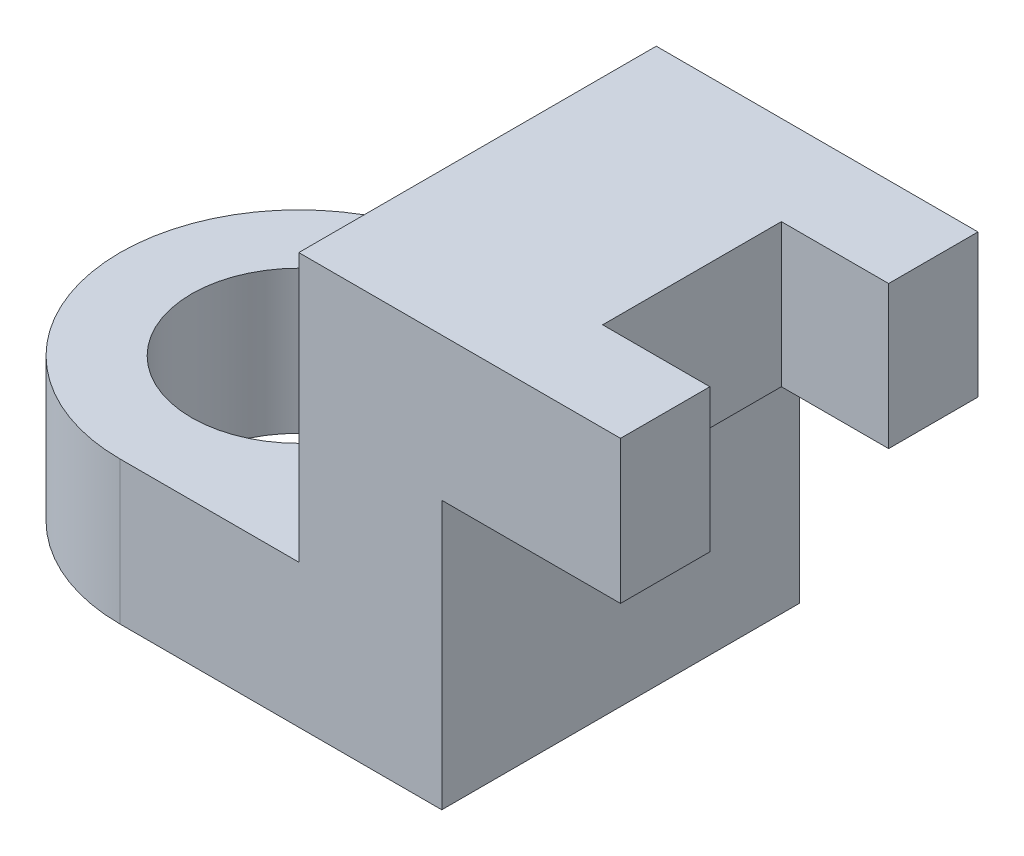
ISO-10303-21;
HEADER;
FILE_DESCRIPTION(('STEP AP214'),'2;1');
FILE_NAME('part.step','',(''),(''),'','','');
FILE_SCHEMA(('AUTOMOTIVE_DESIGN { 1 0 10303 214 1 1 1 1 }'));
ENDSEC;
DATA;
#1=APPLICATION_CONTEXT('core data for automotive mechanical design processes');
#2=APPLICATION_PROTOCOL_DEFINITION('international standard','automotive_design',2000,#1);
#3=PRODUCT_CONTEXT('',#1,'mechanical');
#4=PRODUCT('Part','Part','',(#3));
#5=PRODUCT_RELATED_PRODUCT_CATEGORY('part','',(#4));
#6=PRODUCT_DEFINITION_FORMATION('','',#4);
#7=PRODUCT_DEFINITION_CONTEXT('part definition',#1,'design');
#8=PRODUCT_DEFINITION('design','',#6,#7);
#9=PRODUCT_DEFINITION_SHAPE('','',#8);
#10=(LENGTH_UNIT() NAMED_UNIT(*) SI_UNIT(.MILLI.,.METRE.));
#11=(NAMED_UNIT(*) PLANE_ANGLE_UNIT() SI_UNIT($,.RADIAN.));
#12=(NAMED_UNIT(*) SI_UNIT($,.STERADIAN.) SOLID_ANGLE_UNIT());
#13=UNCERTAINTY_MEASURE_WITH_UNIT(LENGTH_MEASURE(1.E-05),#10,'distance_accuracy_value','');
#14=(GEOMETRIC_REPRESENTATION_CONTEXT(3) GLOBAL_UNCERTAINTY_ASSIGNED_CONTEXT((#13)) GLOBAL_UNIT_ASSIGNED_CONTEXT((#10,
#11,#12)) REPRESENTATION_CONTEXT('',''));
#15=CARTESIAN_POINT('',(0.,0.,0.));
#16=DIRECTION('',(0.,0.,1.));
#17=DIRECTION('',(1.,0.,0.));
#18=AXIS2_PLACEMENT_3D('',#15,#16,#17);
#19=CARTESIAN_POINT('',(38.,67.540659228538,-20.));
#20=DIRECTION('',(1.,0.,0.));
#21=DIRECTION('',(0.,0.,-1.));
#22=AXIS2_PLACEMENT_3D('',#19,#20,#21);
#23=PLANE('',#22);
#24=DIRECTION('',(0.,-1.,0.));
#25=VECTOR('',#24,1.);
#26=CARTESIAN_POINT('',(38.,67.540659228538,-5.));
#27=LINE('',#26,#25);
#28=CARTESIAN_POINT('',(38.,23.,-5.));
#29=VERTEX_POINT('',#28);
#30=CARTESIAN_POINT('',(38.,15.,-5.));
#31=VERTEX_POINT('',#30);
#32=EDGE_CURVE('E41',#29,#31,#27,.T.);
#33=ORIENTED_EDGE('',*,*,#32,.F.);
#34=DIRECTION('',(0.,0.,1.));
#35=VECTOR('',#34,1.);
#36=CARTESIAN_POINT('',(38.,23.,0.));
#37=LINE('',#36,#35);
#38=CARTESIAN_POINT('',(38.,23.,0.));
#39=VERTEX_POINT('',#38);
#40=EDGE_CURVE('E145',#29,#39,#37,.T.);
#41=ORIENTED_EDGE('',*,*,#40,.T.);
#42=DIRECTION('',(0.,-1.,0.));
#43=VECTOR('',#42,1.);
#44=CARTESIAN_POINT('',(38.,23.,0.));
#45=LINE('',#44,#43);
#46=CARTESIAN_POINT('',(38.,15.,0.));
#47=VERTEX_POINT('',#46);
#48=EDGE_CURVE('E144',#39,#47,#45,.T.);
#49=ORIENTED_EDGE('',*,*,#48,.T.);
#50=DIRECTION('',(0.,0.,-1.));
#51=VECTOR('',#50,1.);
#52=CARTESIAN_POINT('',(38.,15.,0.));
#53=LINE('',#52,#51);
#54=EDGE_CURVE('E221',#47,#31,#53,.T.);
#55=ORIENTED_EDGE('',*,*,#54,.T.);
#56=EDGE_LOOP('',(#33,#41,#49,#55));
#57=FACE_BOUND('',#56,.T.);
#58=ADVANCED_FACE('F33',(#57),#23,.T.);
#59=CARTESIAN_POINT('',(28.,8.,0.));
#60=DIRECTION('',(-1.,0.,0.));
#61=DIRECTION('',(0.,0.,1.));
#62=AXIS2_PLACEMENT_3D('',#59,#60,#61);
#63=PLANE('',#62);
#64=DIRECTION('',(0.,0.,-1.));
#65=VECTOR('',#64,1.);
#66=CARTESIAN_POINT('',(28.,15.,0.));
#67=LINE('',#66,#65);
#68=CARTESIAN_POINT('',(28.,15.,0.));
#69=VERTEX_POINT('',#68);
#70=CARTESIAN_POINT('',(28.,15.,-20.));
#71=VERTEX_POINT('',#70);
#72=EDGE_CURVE('E56',#69,#71,#67,.T.);
#73=ORIENTED_EDGE('',*,*,#72,.F.);
#74=DIRECTION('',(0.,-1.,0.));
#75=VECTOR('',#74,1.);
#76=CARTESIAN_POINT('',(28.,8.,0.));
#77=LINE('',#76,#75);
#78=CARTESIAN_POINT('',(28.,0.,0.));
#79=VERTEX_POINT('',#78);
#80=EDGE_CURVE('E242',#69,#79,#77,.T.);
#81=ORIENTED_EDGE('',*,*,#80,.T.);
#82=DIRECTION('',(0.,0.,-1.));
#83=VECTOR('',#82,1.);
#84=CARTESIAN_POINT('',(28.,0.,0.));
#85=LINE('',#84,#83);
#86=CARTESIAN_POINT('',(28.,0.,-20.));
#87=VERTEX_POINT('',#86);
#88=EDGE_CURVE('E248',#79,#87,#85,.T.);
#89=ORIENTED_EDGE('',*,*,#88,.T.);
#90=DIRECTION('',(0.,-1.,0.));
#91=VECTOR('',#90,1.);
#92=CARTESIAN_POINT('',(28.,8.,-20.));
#93=LINE('',#92,#91);
#94=EDGE_CURVE('E197',#71,#87,#93,.T.);
#95=ORIENTED_EDGE('',*,*,#94,.F.);
#96=EDGE_LOOP('',(#73,#81,#89,#95));
#97=FACE_BOUND('',#96,.T.);
#98=ADVANCED_FACE('F261',(#97),#63,.F.);
#99=CARTESIAN_POINT('',(10.,8.,-10.));
#100=DIRECTION('',(0.,-1.,0.));
#101=DIRECTION('',(0.,0.,-1.));
#102=AXIS2_PLACEMENT_3D('',#99,#100,#101);
#103=CYLINDRICAL_SURFACE('',#102,10.);
#104=DIRECTION('',(0.,-1.,0.));
#105=VECTOR('',#104,1.);
#106=CARTESIAN_POINT('',(10.,8.,0.));
#107=LINE('',#106,#105);
#108=CARTESIAN_POINT('',(10.,8.,0.));
#109=VERTEX_POINT('',#108);
#110=CARTESIAN_POINT('',(10.,0.,0.));
#111=VERTEX_POINT('',#110);
#112=EDGE_CURVE('E187',#109,#111,#107,.T.);
#113=ORIENTED_EDGE('',*,*,#112,.F.);
#114=CARTESIAN_POINT('',(10.,8.,-10.));
#115=DIRECTION('',(0.,-1.,0.));
#116=DIRECTION('',(0.,0.,-1.));
#117=AXIS2_PLACEMENT_3D('',#114,#115,#116);
#118=CIRCLE('',#117,10.);
#119=CARTESIAN_POINT('',(10.,8.,-20.));
#120=VERTEX_POINT('',#119);
#121=EDGE_CURVE('E417',#120,#109,#118,.F.);
#122=ORIENTED_EDGE('',*,*,#121,.F.);
#123=DIRECTION('',(0.,-1.,0.));
#124=VECTOR('',#123,1.);
#125=CARTESIAN_POINT('',(10.,8.,-20.));
#126=LINE('',#125,#124);
#127=CARTESIAN_POINT('',(10.,0.,-20.));
#128=VERTEX_POINT('',#127);
#129=EDGE_CURVE('E260',#128,#120,#126,.F.);
#130=ORIENTED_EDGE('',*,*,#129,.F.);
#131=CARTESIAN_POINT('',(10.,0.,-10.));
#132=DIRECTION('',(0.,-1.,0.));
#133=DIRECTION('',(0.,0.,-1.));
#134=AXIS2_PLACEMENT_3D('',#131,#132,#133);
#135=CIRCLE('',#134,10.);
#136=EDGE_CURVE('E129',#111,#128,#135,.T.);
#137=ORIENTED_EDGE('',*,*,#136,.F.);
#138=EDGE_LOOP('',(#113,#122,#130,#137));
#139=FACE_BOUND('',#138,.T.);
#140=ADVANCED_FACE('F35',(#139),#103,.T.);
#141=CARTESIAN_POINT('',(0.,8.,-20.));
#142=DIRECTION('',(0.,-1.,0.));
#143=DIRECTION('',(0.,0.,-1.));
#144=AXIS2_PLACEMENT_3D('',#141,#142,#143);
#145=PLANE('',#144);
#146=CARTESIAN_POINT('',(10.,8.,-10.));
#147=DIRECTION('',(0.,1.,0.));
#148=DIRECTION('',(0.,0.,1.));
#149=AXIS2_PLACEMENT_3D('',#146,#147,#148);
#150=CIRCLE('',#149,6.);
#151=CARTESIAN_POINT('',(10.,8.,-4.));
#152=VERTEX_POINT('',#151);
#153=EDGE_CURVE('E157',#152,#152,#150,.T.);
#154=ORIENTED_EDGE('',*,*,#153,.F.);
#155=EDGE_LOOP('',(#154));
#156=FACE_BOUND('',#155,.T.);
#157=DIRECTION('',(-1.,0.,0.));
#158=VECTOR('',#157,1.);
#159=CARTESIAN_POINT('',(0.,8.,-20.));
#160=LINE('',#159,#158);
#161=CARTESIAN_POINT('',(20.,8.,-20.));
#162=VERTEX_POINT('',#161);
#163=EDGE_CURVE('E185',#162,#120,#160,.T.);
#164=ORIENTED_EDGE('',*,*,#163,.T.);
#165=ORIENTED_EDGE('',*,*,#121,.T.);
#166=DIRECTION('',(1.,0.,0.));
#167=VECTOR('',#166,1.);
#168=CARTESIAN_POINT('',(0.,8.,0.));
#169=LINE('',#168,#167);
#170=CARTESIAN_POINT('',(20.,8.,0.));
#171=VERTEX_POINT('',#170);
#172=EDGE_CURVE('E183',#109,#171,#169,.T.);
#173=ORIENTED_EDGE('',*,*,#172,.T.);
#174=DIRECTION('',(0.,0.,1.));
#175=VECTOR('',#174,1.);
#176=CARTESIAN_POINT('',(20.,8.,-20.));
#177=LINE('',#176,#175);
#178=EDGE_CURVE('E156',#162,#171,#177,.T.);
#179=ORIENTED_EDGE('',*,*,#178,.F.);
#180=EDGE_LOOP('',(#164,#165,#173,#179));
#181=FACE_BOUND('',#180,.T.);
#182=ADVANCED_FACE('F268',(#156,#181),#145,.F.);
#183=CARTESIAN_POINT('',(0.,8.,0.));
#184=DIRECTION('',(0.,0.,-1.));
#185=DIRECTION('',(-1.,0.,0.));
#186=AXIS2_PLACEMENT_3D('',#183,#184,#185);
#187=PLANE('',#186);
#188=ORIENTED_EDGE('',*,*,#172,.F.);
#189=ORIENTED_EDGE('',*,*,#112,.T.);
#190=DIRECTION('',(1.,0.,0.));
#191=VECTOR('',#190,1.);
#192=CARTESIAN_POINT('',(0.,0.,0.));
#193=LINE('',#192,#191);
#194=EDGE_CURVE('E167',#111,#79,#193,.T.);
#195=ORIENTED_EDGE('',*,*,#194,.T.);
#196=ORIENTED_EDGE('',*,*,#80,.F.);
#197=DIRECTION('',(-1.,0.,0.));
#198=VECTOR('',#197,1.);
#199=CARTESIAN_POINT('',(77.540659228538,15.,0.));
#200=LINE('',#199,#198);
#201=EDGE_CURVE('E227',#47,#69,#200,.T.);
#202=ORIENTED_EDGE('',*,*,#201,.F.);
#203=ORIENTED_EDGE('',*,*,#48,.F.);
#204=DIRECTION('',(-1.,0.,0.));
#205=VECTOR('',#204,1.);
#206=CARTESIAN_POINT('',(20.,23.,0.));
#207=LINE('',#206,#205);
#208=CARTESIAN_POINT('',(20.,23.,0.));
#209=VERTEX_POINT('',#208);
#210=EDGE_CURVE('E160',#39,#209,#207,.T.);
#211=ORIENTED_EDGE('',*,*,#210,.T.);
#212=DIRECTION('',(0.,-1.,0.));
#213=VECTOR('',#212,1.);
#214=CARTESIAN_POINT('',(20.,67.540659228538,0.));
#215=LINE('',#214,#213);
#216=EDGE_CURVE('E180',#209,#171,#215,.T.);
#217=ORIENTED_EDGE('',*,*,#216,.T.);
#218=EDGE_LOOP('',(#188,#189,#195,#196,#202,#203,#211,#217));
#219=FACE_BOUND('',#218,.T.);
#220=ADVANCED_FACE('F215',(#219),#187,.F.);
#221=CARTESIAN_POINT('',(0.,8.,-20.));
#222=DIRECTION('',(0.,0.,1.));
#223=DIRECTION('',(1.,0.,0.));
#224=AXIS2_PLACEMENT_3D('',#221,#222,#223);
#225=PLANE('',#224);
#226=DIRECTION('',(-1.,0.,0.));
#227=VECTOR('',#226,1.);
#228=CARTESIAN_POINT('',(0.,0.,-20.));
#229=LINE('',#228,#227);
#230=EDGE_CURVE('E186',#87,#128,#229,.T.);
#231=ORIENTED_EDGE('',*,*,#230,.T.);
#232=ORIENTED_EDGE('',*,*,#129,.T.);
#233=ORIENTED_EDGE('',*,*,#163,.F.);
#234=DIRECTION('',(0.,-1.,0.));
#235=VECTOR('',#234,1.);
#236=CARTESIAN_POINT('',(20.,67.540659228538,-20.));
#237=LINE('',#236,#235);
#238=CARTESIAN_POINT('',(20.,23.,-20.));
#239=VERTEX_POINT('',#238);
#240=EDGE_CURVE('E175',#239,#162,#237,.T.);
#241=ORIENTED_EDGE('',*,*,#240,.F.);
#242=DIRECTION('',(1.,0.,0.));
#243=VECTOR('',#242,1.);
#244=CARTESIAN_POINT('',(20.,23.,-20.));
#245=LINE('',#244,#243);
#246=CARTESIAN_POINT('',(38.,23.,-20.));
#247=VERTEX_POINT('',#246);
#248=EDGE_CURVE('E164',#239,#247,#245,.T.);
#249=ORIENTED_EDGE('',*,*,#248,.T.);
#250=DIRECTION('',(0.,1.,0.));
#251=VECTOR('',#250,1.);
#252=CARTESIAN_POINT('',(38.,23.,-20.));
#253=LINE('',#252,#251);
#254=CARTESIAN_POINT('',(38.,15.,-20.));
#255=VERTEX_POINT('',#254);
#256=EDGE_CURVE('E143',#255,#247,#253,.T.);
#257=ORIENTED_EDGE('',*,*,#256,.F.);
#258=DIRECTION('',(-1.,0.,0.));
#259=VECTOR('',#258,1.);
#260=CARTESIAN_POINT('',(77.540659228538,15.,-20.));
#261=LINE('',#260,#259);
#262=EDGE_CURVE('E150',#255,#71,#261,.T.);
#263=ORIENTED_EDGE('',*,*,#262,.T.);
#264=ORIENTED_EDGE('',*,*,#94,.T.);
#265=EDGE_LOOP('',(#231,#232,#233,#241,#249,#257,#263,#264));
#266=FACE_BOUND('',#265,.T.);
#267=ADVANCED_FACE('F207',(#266),#225,.F.);
#268=CARTESIAN_POINT('',(0.,0.,-20.));
#269=DIRECTION('',(0.,-1.,0.));
#270=DIRECTION('',(0.,0.,-1.));
#271=AXIS2_PLACEMENT_3D('',#268,#269,#270);
#272=PLANE('',#271);
#273=CARTESIAN_POINT('',(10.,0.,-10.));
#274=DIRECTION('',(0.,1.,0.));
#275=DIRECTION('',(0.,0.,1.));
#276=AXIS2_PLACEMENT_3D('',#273,#274,#275);
#277=CIRCLE('',#276,6.);
#278=CARTESIAN_POINT('',(10.,0.,-4.));
#279=VERTEX_POINT('',#278);
#280=EDGE_CURVE('E153',#279,#279,#277,.T.);
#281=ORIENTED_EDGE('',*,*,#280,.T.);
#282=EDGE_LOOP('',(#281));
#283=FACE_BOUND('',#282,.T.);
#284=ORIENTED_EDGE('',*,*,#194,.F.);
#285=ORIENTED_EDGE('',*,*,#136,.T.);
#286=ORIENTED_EDGE('',*,*,#230,.F.);
#287=ORIENTED_EDGE('',*,*,#88,.F.);
#288=EDGE_LOOP('',(#284,#285,#286,#287));
#289=FACE_BOUND('',#288,.T.);
#290=ADVANCED_FACE('F257',(#283,#289),#272,.T.);
#291=CARTESIAN_POINT('',(20.,67.540659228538,-20.));
#292=DIRECTION('',(1.,0.,0.));
#293=DIRECTION('',(0.,0.,-1.));
#294=AXIS2_PLACEMENT_3D('',#291,#292,#293);
#295=PLANE('',#294);
#296=ORIENTED_EDGE('',*,*,#216,.F.);
#297=DIRECTION('',(0.,0.,-1.));
#298=VECTOR('',#297,1.);
#299=CARTESIAN_POINT('',(20.,23.,-20.));
#300=LINE('',#299,#298);
#301=EDGE_CURVE('E163',#209,#239,#300,.T.);
#302=ORIENTED_EDGE('',*,*,#301,.T.);
#303=ORIENTED_EDGE('',*,*,#240,.T.);
#304=ORIENTED_EDGE('',*,*,#178,.T.);
#305=EDGE_LOOP('',(#296,#302,#303,#304));
#306=FACE_BOUND('',#305,.T.);
#307=ADVANCED_FACE('F213',(#306),#295,.F.);
#308=CARTESIAN_POINT('',(0.,23.,-20.));
#309=DIRECTION('',(0.,-1.,0.));
#310=DIRECTION('',(0.,0.,-1.));
#311=AXIS2_PLACEMENT_3D('',#308,#309,#310);
#312=PLANE('',#311);
#313=ORIENTED_EDGE('',*,*,#40,.F.);
#314=DIRECTION('',(1.,0.,0.));
#315=VECTOR('',#314,1.);
#316=CARTESIAN_POINT('',(38.,23.,-5.));
#317=LINE('',#316,#315);
#318=CARTESIAN_POINT('',(32.,23.,-5.));
#319=VERTEX_POINT('',#318);
#320=EDGE_CURVE('E217',#319,#29,#317,.T.);
#321=ORIENTED_EDGE('',*,*,#320,.F.);
#322=DIRECTION('',(0.,0.,1.));
#323=VECTOR('',#322,1.);
#324=CARTESIAN_POINT('',(32.,23.,-15.));
#325=LINE('',#324,#323);
#326=CARTESIAN_POINT('',(32.,23.,-15.));
#327=VERTEX_POINT('',#326);
#328=EDGE_CURVE('E139',#327,#319,#325,.T.);
#329=ORIENTED_EDGE('',*,*,#328,.F.);
#330=DIRECTION('',(-1.,0.,0.));
#331=VECTOR('',#330,1.);
#332=CARTESIAN_POINT('',(38.,23.,-15.));
#333=LINE('',#332,#331);
#334=CARTESIAN_POINT('',(38.,23.,-15.));
#335=VERTEX_POINT('',#334);
#336=EDGE_CURVE('E124',#335,#327,#333,.T.);
#337=ORIENTED_EDGE('',*,*,#336,.F.);
#338=EDGE_CURVE('E135',#247,#335,#37,.T.);
#339=ORIENTED_EDGE('',*,*,#338,.F.);
#340=ORIENTED_EDGE('',*,*,#248,.F.);
#341=ORIENTED_EDGE('',*,*,#301,.F.);
#342=ORIENTED_EDGE('',*,*,#210,.F.);
#343=EDGE_LOOP('',(#313,#321,#329,#337,#339,#340,#341,#342));
#344=FACE_BOUND('',#343,.T.);
#345=ADVANCED_FACE('F134',(#344),#312,.F.);
#346=CARTESIAN_POINT('',(10.,0.,-10.));
#347=DIRECTION('',(0.,1.,0.));
#348=DIRECTION('',(0.,0.,1.));
#349=AXIS2_PLACEMENT_3D('',#346,#347,#348);
#350=CYLINDRICAL_SURFACE('',#349,6.);
#351=ORIENTED_EDGE('',*,*,#280,.F.);
#352=EDGE_LOOP('',(#351));
#353=FACE_BOUND('',#352,.T.);
#354=ORIENTED_EDGE('',*,*,#153,.T.);
#355=EDGE_LOOP('',(#354));
#356=FACE_BOUND('',#355,.T.);
#357=ADVANCED_FACE('F293',(#353,#356),#350,.F.);
#358=CARTESIAN_POINT('',(77.540659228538,15.,0.));
#359=DIRECTION('',(0.,1.,0.));
#360=DIRECTION('',(0.,0.,1.));
#361=AXIS2_PLACEMENT_3D('',#358,#359,#360);
#362=PLANE('',#361);
#363=DIRECTION('',(0.,0.,1.));
#364=VECTOR('',#363,1.);
#365=CARTESIAN_POINT('',(32.,15.,0.));
#366=LINE('',#365,#364);
#367=CARTESIAN_POINT('',(32.,15.,-15.));
#368=VERTEX_POINT('',#367);
#369=CARTESIAN_POINT('',(32.,15.,-5.));
#370=VERTEX_POINT('',#369);
#371=EDGE_CURVE('E12',#368,#370,#366,.T.);
#372=ORIENTED_EDGE('',*,*,#371,.T.);
#373=DIRECTION('',(1.,0.,0.));
#374=VECTOR('',#373,1.);
#375=CARTESIAN_POINT('',(77.540659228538,15.,-5.));
#376=LINE('',#375,#374);
#377=EDGE_CURVE('E230',#370,#31,#376,.T.);
#378=ORIENTED_EDGE('',*,*,#377,.T.);
#379=ORIENTED_EDGE('',*,*,#54,.F.);
#380=ORIENTED_EDGE('',*,*,#201,.T.);
#381=ORIENTED_EDGE('',*,*,#72,.T.);
#382=ORIENTED_EDGE('',*,*,#262,.F.);
#383=CARTESIAN_POINT('',(38.,15.,-15.));
#384=VERTEX_POINT('',#383);
#385=EDGE_CURVE('E148',#384,#255,#53,.T.);
#386=ORIENTED_EDGE('',*,*,#385,.F.);
#387=DIRECTION('',(-1.,0.,0.));
#388=VECTOR('',#387,1.);
#389=CARTESIAN_POINT('',(77.540659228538,15.,-15.));
#390=LINE('',#389,#388);
#391=EDGE_CURVE('E48',#384,#368,#390,.T.);
#392=ORIENTED_EDGE('',*,*,#391,.T.);
#393=EDGE_LOOP('',(#372,#378,#379,#380,#381,#382,#386,#392));
#394=FACE_BOUND('',#393,.T.);
#395=ADVANCED_FACE('F240',(#394),#362,.F.);
#396=DIRECTION('',(0.,1.,0.));
#397=VECTOR('',#396,1.);
#398=CARTESIAN_POINT('',(38.,67.540659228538,-15.));
#399=LINE('',#398,#397);
#400=EDGE_CURVE('E121',#384,#335,#399,.T.);
#401=ORIENTED_EDGE('',*,*,#400,.F.);
#402=ORIENTED_EDGE('',*,*,#385,.T.);
#403=ORIENTED_EDGE('',*,*,#256,.T.);
#404=ORIENTED_EDGE('',*,*,#338,.T.);
#405=EDGE_LOOP('',(#401,#402,#403,#404));
#406=FACE_BOUND('',#405,.T.);
#407=ADVANCED_FACE('F141',(#406),#23,.T.);
#408=CARTESIAN_POINT('',(32.,-2.50000000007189E-05,-15.));
#409=DIRECTION('',(-1.,0.,0.));
#410=DIRECTION('',(0.,0.,1.));
#411=AXIS2_PLACEMENT_3D('',#408,#409,#410);
#412=PLANE('',#411);
#413=DIRECTION('',(0.,1.,0.));
#414=VECTOR('',#413,1.);
#415=CARTESIAN_POINT('',(32.,-2.50000000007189E-05,-15.));
#416=LINE('',#415,#414);
#417=EDGE_CURVE('E316',#368,#327,#416,.T.);
#418=ORIENTED_EDGE('',*,*,#417,.T.);
#419=ORIENTED_EDGE('',*,*,#328,.T.);
#420=DIRECTION('',(0.,1.,0.));
#421=VECTOR('',#420,1.);
#422=CARTESIAN_POINT('',(32.,-2.50000000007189E-05,-5.));
#423=LINE('',#422,#421);
#424=EDGE_CURVE('E315',#370,#319,#423,.T.);
#425=ORIENTED_EDGE('',*,*,#424,.F.);
#426=ORIENTED_EDGE('',*,*,#371,.F.);
#427=EDGE_LOOP('',(#418,#419,#425,#426));
#428=FACE_BOUND('',#427,.T.);
#429=ADVANCED_FACE('F303',(#428),#412,.F.);
#430=CARTESIAN_POINT('',(38.,-2.50000000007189E-05,-5.));
#431=DIRECTION('',(0.,0.,1.));
#432=DIRECTION('',(1.,0.,0.));
#433=AXIS2_PLACEMENT_3D('',#430,#431,#432);
#434=PLANE('',#433);
#435=ORIENTED_EDGE('',*,*,#424,.T.);
#436=ORIENTED_EDGE('',*,*,#320,.T.);
#437=ORIENTED_EDGE('',*,*,#32,.T.);
#438=ORIENTED_EDGE('',*,*,#377,.F.);
#439=EDGE_LOOP('',(#435,#436,#437,#438));
#440=FACE_BOUND('',#439,.T.);
#441=ADVANCED_FACE('F307',(#440),#434,.F.);
#442=CARTESIAN_POINT('',(38.,-2.50000000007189E-05,-15.));
#443=DIRECTION('',(0.,0.,-1.));
#444=DIRECTION('',(-1.,0.,0.));
#445=AXIS2_PLACEMENT_3D('',#442,#443,#444);
#446=PLANE('',#445);
#447=ORIENTED_EDGE('',*,*,#400,.T.);
#448=ORIENTED_EDGE('',*,*,#336,.T.);
#449=ORIENTED_EDGE('',*,*,#417,.F.);
#450=ORIENTED_EDGE('',*,*,#391,.F.);
#451=EDGE_LOOP('',(#447,#448,#449,#450));
#452=FACE_BOUND('',#451,.T.);
#453=ADVANCED_FACE('F123',(#452),#446,.F.);
#454=CLOSED_SHELL('',(#58,#98,#140,#182,#220,#267,#290,#307,#345,#357,#395,#407,#429,#441,#453));
#455=MANIFOLD_SOLID_BREP('B2',#454);
#456=ADVANCED_BREP_SHAPE_REPRESENTATION('',(#18,#455),#14);
#457=SHAPE_DEFINITION_REPRESENTATION(#9,#456);
ENDSEC;
END-ISO-10303-21;
